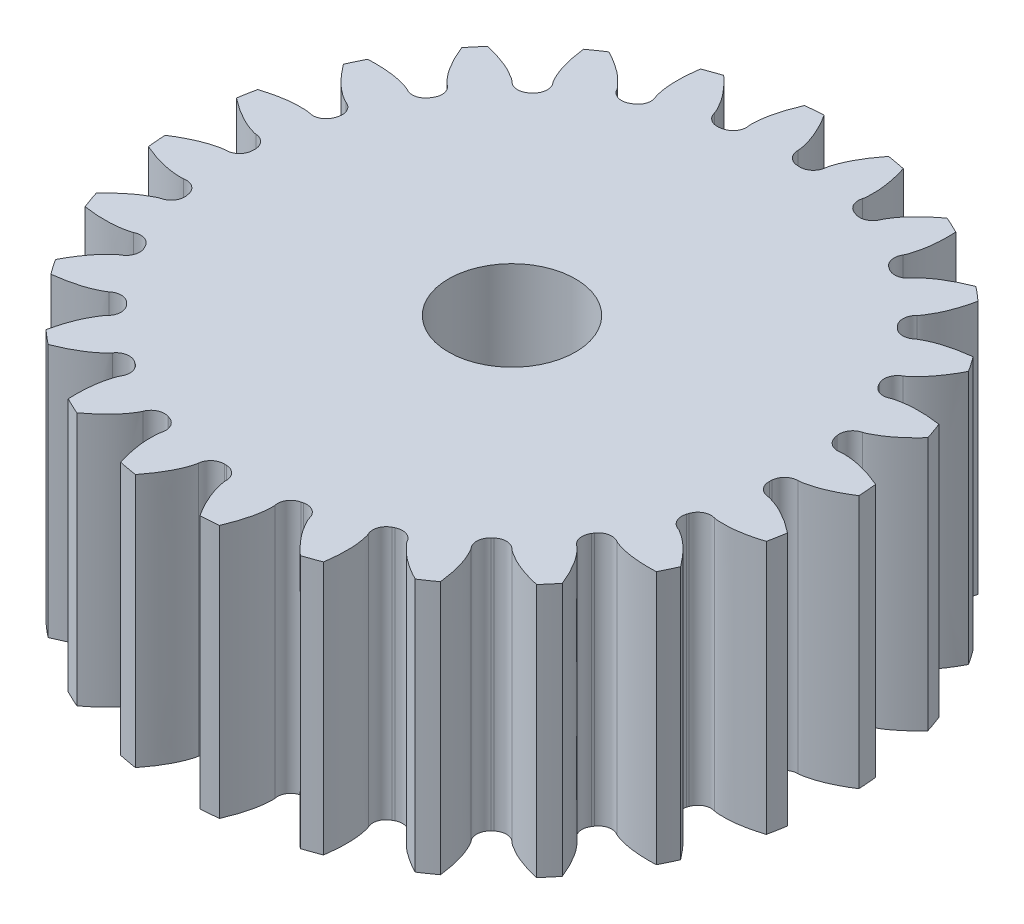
from build123d import *

# Parameters (mm, degrees)
ESQUISSE1_R             = 5.2
ESQUISSE1_R_2           = 1
BOSS_EXTRU_1_DEPTH      = 4
ESQUISSE2_OUTSIDE_W     = 15.448
ESQUISSE2_OUTSIDE_H     = 15.448
ENL_V_MAT_EXTRU_1_DEPTH = 9.371379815


with BuildPart() as part:
    # Esquisse1 → Boss.-Extru.1 (new body)
    with BuildSketch(Plane(origin=(0, 0, 0), x_dir=(1, 0, 0), z_dir=(0, 1, 0))):
        with Locations(Location((0, 0, 0), (0, 0, 270))):
            Circle(ESQUISSE1_R)
        with Locations(Location((0, 0, 0), (0, 0, 270))):
            Circle(ESQUISSE1_R_2, mode=Mode.SUBTRACT)
    extrude(amount=BOSS_EXTRU_1_DEPTH)

    # Esquisse2 outside → Enl_v. mat.-Extru.1 (cut, through all)
    with BuildSketch(Plane(origin=(0, 4, 0), x_dir=(1, 0, 0), z_dir=(0, 1, 0))):
        Rectangle(ESQUISSE2_OUTSIDE_W, ESQUISSE2_OUTSIDE_H)
        with BuildLine():
            ThreePointArc((5.192767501, 0.274163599), (5.183221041, 0.417396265), (5.169724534, 0.56031084))
            add(Edge.make_bspline(
                [(4.452870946, 0.721845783), (4.475733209, 0.725551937), (4.575678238, 0.72530917), (4.738040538, 0.704363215), (4.954249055, 0.646473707), (5.092861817, 0.593915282), (5.169724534, 0.56031084)],
                knots=[0, 0, 0, 0, 0.06948214, 0.297904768, 0.489604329, 0.740187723, 0.740187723, 0.740187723, 0.740187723], degree=3))
            ThreePointArc((4.452870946, 0.721845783), (4.296922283, 0.753905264), (4.207770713, 0.885813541))
            ThreePointArc((4.207770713, 0.885813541), (4.204404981, 0.901653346), (4.200979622, 0.917480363))
            ThreePointArc((4.200979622, 0.917480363), (4.228202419, 1.07434564), (4.357291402, 1.167532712))
            add(Edge.make_bspline(
                [(4.357291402, 1.167532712), (4.379662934, 1.173527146), (4.470719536, 1.214731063), (4.610215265, 1.300411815), (4.783673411, 1.441867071), (4.888545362, 1.546641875), (4.944869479, 1.608808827)],
                knots=[0, 0, 0, 0, 0.06948214, 0.297904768, 0.489604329, 0.740187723, 0.740187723, 0.740187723, 0.740187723], degree=3))
            ThreePointArc((4.944869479, 1.608808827), (4.898576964, 1.744690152), (4.848551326, 1.879241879))
            add(Edge.make_bspline(
                [(4.114315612, 1.849737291), (4.135439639, 1.85923435), (4.232041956, 1.884867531), (4.394293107, 1.906657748), (4.618117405, 1.90669966), (4.765610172, 1.891807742), (4.848551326, 1.879241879)],
                knots=[0, 0, 0, 0, 0.06948214, 0.297904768, 0.489604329, 0.740187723, 0.740187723, 0.740187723, 0.740187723], degree=3))
            ThreePointArc((4.114315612, 1.849737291), (3.955383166, 1.840341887), (3.835128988, 1.944681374))
            ThreePointArc((3.835128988, 1.944681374), (3.827778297, 1.959110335), (3.820373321, 1.973511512))
            ThreePointArc((3.820373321, 1.973511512), (3.806068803, 2.132077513), (3.906640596, 2.2555))
            add(Edge.make_bspline(
                [(3.906640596, 2.2555), (3.926698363, 2.267080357), (4.003987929, 2.330447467), (4.116554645, 2.44931287), (4.247491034, 2.630842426), (4.321671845, 2.759189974), (4.359986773, 2.833816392)],
                knots=[0, 0, 0, 0, 0.06948214, 0.297904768, 0.489604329, 0.740187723, 0.740187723, 0.740187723, 0.740187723], degree=3))
            ThreePointArc((4.359986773, 2.833816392), (4.280102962, 2.953086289), (4.196957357, 3.070105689))
            add(Edge.make_bspline(
                [(3.495376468, 2.851572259), (3.513322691, 2.866213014), (3.599999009, 2.915975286), (3.751081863, 2.979016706), (3.967268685, 3.036987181), (4.11359007, 3.060776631), (4.196957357, 3.070105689)],
                knots=[0, 0, 0, 0, 0.06948214, 0.297904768, 0.489604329, 0.740187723, 0.740187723, 0.740187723, 0.740187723], degree=3))
            ThreePointArc((3.495376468, 2.851572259), (3.344291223, 2.801362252), (3.20112956, 2.871022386))
            ThreePointArc((3.20112956, 2.871022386), (3.190294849, 2.883057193), (3.179414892, 2.895051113))
            ThreePointArc((3.179414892, 2.895051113), (3.124557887, 3.044511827), (3.18975869, 3.18975869))
            add(Edge.make_bspline(
                [(3.18975869, 3.18975869), (3.206135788, 3.206135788), (3.26439116, 3.287347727), (3.342357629, 3.4312973), (3.421849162, 3.640530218), (3.460283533, 3.783703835), (3.477978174, 3.865704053)],
                knots=[0, 0, 0, 0, 0.06948214, 0.297904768, 0.489604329, 0.740187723, 0.740187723, 0.740187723, 0.740187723], degree=3))
            ThreePointArc((3.477978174, 3.865704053), (3.369947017, 3.960234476), (3.259347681, 4.05174687))
            add(Edge.make_bspline(
                [(2.638233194, 3.65907729), (2.651778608, 3.677863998), (2.722622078, 3.748364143), (2.852240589, 3.8483606), (3.04605716, 3.960309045), (3.181235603, 4.02115865), (3.259347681, 4.05174687)],
                knots=[0, 0, 0, 0, 0.06948214, 0.297904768, 0.489604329, 0.740187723, 0.740187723, 0.740187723, 0.740187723], degree=3))
            ThreePointArc((2.638233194, 3.65907729), (2.50529136, 3.571474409), (2.348978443, 3.601707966))
            ThreePointArc((2.348978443, 3.601707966), (2.335398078, 3.610528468), (2.321784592, 3.619297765))
            ThreePointArc((2.321784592, 3.619297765), (2.230113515, 3.749467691), (2.2555, 3.906640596))
            add(Edge.make_bspline(
                [(2.2555, 3.906640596), (2.267080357, 3.926698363), (2.302331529, 4.020220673), (2.340384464, 4.179444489), (2.363013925, 4.402121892), (2.363082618, 4.550364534), (2.358951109, 4.634150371)],
                knots=[0, 0, 0, 0, 0.06948214, 0.297904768, 0.489604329, 0.740187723, 0.740187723, 0.740187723, 0.740187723], degree=3))
            ThreePointArc((2.358951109, 4.634150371), (2.230134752, 4.697499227), (2.099618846, 4.757268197))
            add(Edge.make_bspline(
                [(1.601298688, 4.217222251), (1.609520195, 4.238874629), (1.659702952, 4.325308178), (1.759023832, 4.455445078), (1.917261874, 4.613742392), (2.032085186, 4.707505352), (2.099618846, 4.757268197)],
                knots=[0, 0, 0, 0, 0.06948214, 0.297904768, 0.489604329, 0.740187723, 0.740187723, 0.740187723, 0.740187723], degree=3))
            ThreePointArc((1.601298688, 4.217222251), (1.495560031, 4.098196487), (1.336748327, 4.086943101))
            ThreePointArc((1.336748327, 4.086943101), (1.321347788, 4.091948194), (1.305928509, 4.096895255))
            ThreePointArc((1.305928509, 4.096895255), (1.183690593, 4.198903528), (1.167532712, 4.357291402))
            add(Edge.make_bspline(
                [(1.167532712, 4.357291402), (1.173527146, 4.379662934), (1.183371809, 4.479122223), (1.178917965, 4.642769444), (1.143143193, 4.863716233), (1.104841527, 5.006925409), (1.079165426, 5.086787)],
                knots=[0, 0, 0, 0, 0.06948214, 0.297904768, 0.489604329, 0.740187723, 0.740187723, 0.740187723, 0.740187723], degree=3))
            ThreePointArc((1.079165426, 5.086787), (0.938342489, 5.114637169), (0.796804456, 5.138589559))
            add(Edge.make_bspline(
                [(0.455238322, 4.487970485), (0.457575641, 4.511012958), (0.483677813, 4.607489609), (0.545932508, 4.758898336), (0.65780836, 4.95275682), (0.744451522, 5.073043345), (0.796804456, 5.138589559)],
                knots=[0, 0, 0, 0, 0.06948214, 0.297904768, 0.489604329, 0.740187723, 0.740187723, 0.740187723, 0.740187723], degree=3))
            ThreePointArc((0.455238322, 4.487970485), (0.383908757, 4.345633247), (0.233421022, 4.293659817))
            ThreePointArc((0.233421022, 4.293659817), (0.21724983, 4.294508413), (0.201075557, 4.295296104))
            ThreePointArc((0.201075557, 4.295296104), (0.056601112, 4.362191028), (0, 4.511))
            add(Edge.make_bspline(
                [(0, 4.511), (0, 4.534160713), (-0.016232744, 4.632778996), (-0.062889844, 4.789697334), (-0.154630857, 4.993856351), (-0.228692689, 5.122272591), (-0.274163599, 5.192767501)],
                knots=[0, 0, 0, 0, 0.06948214, 0.297904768, 0.489604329, 0.740187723, 0.740187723, 0.740187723, 0.740187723], degree=3))
            ThreePointArc((-0.274163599, 5.192767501), (-0.417396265, 5.183221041), (-0.56031084, 5.169724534))
            add(Edge.make_bspline(
                [(-0.721845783, 4.452870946), (-0.725551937, 4.475733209), (-0.72530917, 4.575678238), (-0.704363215, 4.738040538), (-0.646473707, 4.954249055), (-0.593915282, 5.092861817), (-0.56031084, 5.169724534)],
                knots=[0, 0, 0, 0, 0.06948214, 0.297904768, 0.489604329, 0.740187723, 0.740187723, 0.740187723, 0.740187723], degree=3))
            ThreePointArc((-0.721845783, 4.452870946), (-0.753905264, 4.296922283), (-0.885813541, 4.207770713))
            ThreePointArc((-0.885813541, 4.207770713), (-0.901653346, 4.204404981), (-0.917480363, 4.200979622))
            ThreePointArc((-0.917480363, 4.200979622), (-1.07434564, 4.228202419), (-1.167532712, 4.357291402))
            add(Edge.make_bspline(
                [(-1.167532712, 4.357291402), (-1.173527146, 4.379662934), (-1.214731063, 4.470719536), (-1.300411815, 4.610215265), (-1.441867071, 4.783673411), (-1.546641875, 4.888545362), (-1.608808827, 4.944869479)],
                knots=[0, 0, 0, 0, 0.06948214, 0.297904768, 0.489604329, 0.740187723, 0.740187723, 0.740187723, 0.740187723], degree=3))
            ThreePointArc((-1.608808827, 4.944869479), (-1.744690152, 4.898576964), (-1.879241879, 4.848551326))
            add(Edge.make_bspline(
                [(-1.849737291, 4.114315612), (-1.85923435, 4.135439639), (-1.884867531, 4.232041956), (-1.906657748, 4.394293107), (-1.90669966, 4.618117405), (-1.891807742, 4.765610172), (-1.879241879, 4.848551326)],
                knots=[0, 0, 0, 0, 0.06948214, 0.297904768, 0.489604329, 0.740187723, 0.740187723, 0.740187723, 0.740187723], degree=3))
            ThreePointArc((-1.849737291, 4.114315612), (-1.840341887, 3.955383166), (-1.944681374, 3.835128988))
            ThreePointArc((-1.944681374, 3.835128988), (-1.959110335, 3.827778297), (-1.973511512, 3.820373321))
            ThreePointArc((-1.973511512, 3.820373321), (-2.132077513, 3.806068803), (-2.2555, 3.906640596))
            add(Edge.make_bspline(
                [(-2.2555, 3.906640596), (-2.267080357, 3.926698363), (-2.330447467, 4.003987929), (-2.44931287, 4.116554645), (-2.630842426, 4.247491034), (-2.759189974, 4.321671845), (-2.833816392, 4.359986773)],
                knots=[0, 0, 0, 0, 0.06948214, 0.297904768, 0.489604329, 0.740187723, 0.740187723, 0.740187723, 0.740187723], degree=3))
            ThreePointArc((-2.833816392, 4.359986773), (-2.953086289, 4.280102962), (-3.070105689, 4.196957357))
            add(Edge.make_bspline(
                [(-2.851572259, 3.495376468), (-2.866213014, 3.513322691), (-2.915975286, 3.599999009), (-2.979016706, 3.751081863), (-3.036987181, 3.967268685), (-3.060776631, 4.11359007), (-3.070105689, 4.196957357)],
                knots=[0, 0, 0, 0, 0.06948214, 0.297904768, 0.489604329, 0.740187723, 0.740187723, 0.740187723, 0.740187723], degree=3))
            ThreePointArc((-2.851572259, 3.495376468), (-2.801362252, 3.344291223), (-2.871022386, 3.20112956))
            ThreePointArc((-2.871022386, 3.20112956), (-2.883057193, 3.190294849), (-2.895051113, 3.179414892))
            ThreePointArc((-2.895051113, 3.179414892), (-3.044511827, 3.124557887), (-3.18975869, 3.18975869))
            add(Edge.make_bspline(
                [(-3.18975869, 3.18975869), (-3.206135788, 3.206135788), (-3.287347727, 3.26439116), (-3.4312973, 3.342357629), (-3.640530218, 3.421849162), (-3.783703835, 3.460283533), (-3.865704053, 3.477978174)],
                knots=[0, 0, 0, 0, 0.06948214, 0.297904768, 0.489604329, 0.740187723, 0.740187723, 0.740187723, 0.740187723], degree=3))
            ThreePointArc((-3.865704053, 3.477978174), (-3.960234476, 3.369947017), (-4.05174687, 3.259347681))
            add(Edge.make_bspline(
                [(-3.65907729, 2.638233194), (-3.677863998, 2.651778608), (-3.748364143, 2.722622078), (-3.8483606, 2.852240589), (-3.960309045, 3.04605716), (-4.02115865, 3.181235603), (-4.05174687, 3.259347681)],
                knots=[0, 0, 0, 0, 0.06948214, 0.297904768, 0.489604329, 0.740187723, 0.740187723, 0.740187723, 0.740187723], degree=3))
            ThreePointArc((-3.65907729, 2.638233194), (-3.571474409, 2.50529136), (-3.601707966, 2.348978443))
            ThreePointArc((-3.601707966, 2.348978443), (-3.610528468, 2.335398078), (-3.619297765, 2.321784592))
            ThreePointArc((-3.619297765, 2.321784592), (-3.749467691, 2.230113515), (-3.906640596, 2.2555))
            add(Edge.make_bspline(
                [(-3.906640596, 2.2555), (-3.926698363, 2.267080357), (-4.020220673, 2.302331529), (-4.179444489, 2.340384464), (-4.402121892, 2.363013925), (-4.550364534, 2.363082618), (-4.634150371, 2.358951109)],
                knots=[0, 0, 0, 0, 0.06948214, 0.297904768, 0.489604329, 0.740187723, 0.740187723, 0.740187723, 0.740187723], degree=3))
            ThreePointArc((-4.634150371, 2.358951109), (-4.697499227, 2.230134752), (-4.757268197, 2.099618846))
            add(Edge.make_bspline(
                [(-4.217222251, 1.601298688), (-4.238874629, 1.609520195), (-4.325308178, 1.659702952), (-4.455445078, 1.759023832), (-4.613742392, 1.917261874), (-4.707505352, 2.032085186), (-4.757268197, 2.099618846)],
                knots=[0, 0, 0, 0, 0.06948214, 0.297904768, 0.489604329, 0.740187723, 0.740187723, 0.740187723, 0.740187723], degree=3))
            ThreePointArc((-4.217222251, 1.601298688), (-4.098196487, 1.495560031), (-4.086943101, 1.336748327))
            ThreePointArc((-4.086943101, 1.336748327), (-4.091948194, 1.321347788), (-4.096895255, 1.305928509))
            ThreePointArc((-4.096895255, 1.305928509), (-4.198903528, 1.183690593), (-4.357291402, 1.167532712))
            add(Edge.make_bspline(
                [(-4.357291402, 1.167532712), (-4.379662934, 1.173527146), (-4.479122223, 1.183371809), (-4.642769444, 1.178917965), (-4.863716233, 1.143143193), (-5.006925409, 1.104841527), (-5.086787, 1.079165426)],
                knots=[0, 0, 0, 0, 0.06948214, 0.297904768, 0.489604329, 0.740187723, 0.740187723, 0.740187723, 0.740187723], degree=3))
            ThreePointArc((-5.086787, 1.079165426), (-5.114637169, 0.938342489), (-5.138589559, 0.796804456))
            add(Edge.make_bspline(
                [(-4.487970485, 0.455238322), (-4.511012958, 0.457575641), (-4.607489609, 0.483677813), (-4.758898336, 0.545932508), (-4.95275682, 0.65780836), (-5.073043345, 0.744451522), (-5.138589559, 0.796804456)],
                knots=[0, 0, 0, 0, 0.06948214, 0.297904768, 0.489604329, 0.740187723, 0.740187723, 0.740187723, 0.740187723], degree=3))
            ThreePointArc((-4.487970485, 0.455238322), (-4.345633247, 0.383908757), (-4.293659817, 0.233421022))
            ThreePointArc((-4.293659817, 0.233421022), (-4.294508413, 0.21724983), (-4.295296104, 0.201075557))
            ThreePointArc((-4.295296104, 0.201075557), (-4.362191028, 0.056601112), (-4.511, 0))
            add(Edge.make_bspline(
                [(-4.511, 0), (-4.534160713, 0), (-4.632778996, -0.016232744), (-4.789697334, -0.062889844), (-4.993856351, -0.154630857), (-5.122272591, -0.228692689), (-5.192767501, -0.274163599)],
                knots=[0, 0, 0, 0, 0.06948214, 0.297904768, 0.489604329, 0.740187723, 0.740187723, 0.740187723, 0.740187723], degree=3))
            ThreePointArc((-5.192767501, -0.274163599), (-5.183221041, -0.417396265), (-5.169724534, -0.56031084))
            add(Edge.make_bspline(
                [(-4.452870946, -0.721845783), (-4.475733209, -0.725551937), (-4.575678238, -0.72530917), (-4.738040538, -0.704363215), (-4.954249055, -0.646473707), (-5.092861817, -0.593915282), (-5.169724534, -0.56031084)],
                knots=[0, 0, 0, 0, 0.06948214, 0.297904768, 0.489604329, 0.740187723, 0.740187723, 0.740187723, 0.740187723], degree=3))
            ThreePointArc((-4.452870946, -0.721845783), (-4.296922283, -0.753905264), (-4.207770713, -0.885813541))
            ThreePointArc((-4.207770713, -0.885813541), (-4.204404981, -0.901653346), (-4.200979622, -0.917480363))
            ThreePointArc((-4.200979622, -0.917480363), (-4.228202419, -1.07434564), (-4.357291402, -1.167532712))
            add(Edge.make_bspline(
                [(-4.357291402, -1.167532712), (-4.379662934, -1.173527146), (-4.470719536, -1.214731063), (-4.610215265, -1.300411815), (-4.783673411, -1.441867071), (-4.888545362, -1.546641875), (-4.944869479, -1.608808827)],
                knots=[0, 0, 0, 0, 0.06948214, 0.297904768, 0.489604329, 0.740187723, 0.740187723, 0.740187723, 0.740187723], degree=3))
            ThreePointArc((-4.944869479, -1.608808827), (-4.898576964, -1.744690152), (-4.848551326, -1.879241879))
            add(Edge.make_bspline(
                [(-4.114315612, -1.849737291), (-4.135439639, -1.85923435), (-4.232041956, -1.884867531), (-4.394293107, -1.906657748), (-4.618117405, -1.90669966), (-4.765610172, -1.891807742), (-4.848551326, -1.879241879)],
                knots=[0, 0, 0, 0, 0.06948214, 0.297904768, 0.489604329, 0.740187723, 0.740187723, 0.740187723, 0.740187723], degree=3))
            ThreePointArc((-4.114315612, -1.849737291), (-3.955383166, -1.840341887), (-3.835128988, -1.944681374))
            ThreePointArc((-3.835128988, -1.944681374), (-3.827778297, -1.959110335), (-3.820373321, -1.973511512))
            ThreePointArc((-3.820373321, -1.973511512), (-3.806068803, -2.132077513), (-3.906640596, -2.2555))
            add(Edge.make_bspline(
                [(-3.906640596, -2.2555), (-3.926698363, -2.267080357), (-4.003987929, -2.330447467), (-4.116554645, -2.44931287), (-4.247491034, -2.630842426), (-4.321671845, -2.759189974), (-4.359986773, -2.833816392)],
                knots=[0, 0, 0, 0, 0.06948214, 0.297904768, 0.489604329, 0.740187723, 0.740187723, 0.740187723, 0.740187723], degree=3))
            ThreePointArc((-4.359986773, -2.833816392), (-4.280102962, -2.953086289), (-4.196957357, -3.070105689))
            add(Edge.make_bspline(
                [(-3.495376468, -2.851572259), (-3.513322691, -2.866213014), (-3.599999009, -2.915975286), (-3.751081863, -2.979016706), (-3.967268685, -3.036987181), (-4.11359007, -3.060776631), (-4.196957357, -3.070105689)],
                knots=[0, 0, 0, 0, 0.06948214, 0.297904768, 0.489604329, 0.740187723, 0.740187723, 0.740187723, 0.740187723], degree=3))
            ThreePointArc((-3.495376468, -2.851572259), (-3.344291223, -2.801362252), (-3.20112956, -2.871022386))
            ThreePointArc((-3.20112956, -2.871022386), (-3.190294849, -2.883057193), (-3.179414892, -2.895051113))
            ThreePointArc((-3.179414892, -2.895051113), (-3.124557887, -3.044511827), (-3.18975869, -3.18975869))
            add(Edge.make_bspline(
                [(-3.18975869, -3.18975869), (-3.206135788, -3.206135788), (-3.26439116, -3.287347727), (-3.342357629, -3.4312973), (-3.421849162, -3.640530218), (-3.460283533, -3.783703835), (-3.477978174, -3.865704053)],
                knots=[0, 0, 0, 0, 0.06948214, 0.297904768, 0.489604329, 0.740187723, 0.740187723, 0.740187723, 0.740187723], degree=3))
            ThreePointArc((-3.477978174, -3.865704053), (-3.369947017, -3.960234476), (-3.259347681, -4.05174687))
            add(Edge.make_bspline(
                [(-2.638233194, -3.65907729), (-2.651778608, -3.677863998), (-2.722622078, -3.748364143), (-2.852240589, -3.8483606), (-3.04605716, -3.960309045), (-3.181235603, -4.02115865), (-3.259347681, -4.05174687)],
                knots=[0, 0, 0, 0, 0.06948214, 0.297904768, 0.489604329, 0.740187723, 0.740187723, 0.740187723, 0.740187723], degree=3))
            ThreePointArc((-2.638233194, -3.65907729), (-2.50529136, -3.571474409), (-2.348978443, -3.601707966))
            ThreePointArc((-2.348978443, -3.601707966), (-2.335398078, -3.610528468), (-2.321784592, -3.619297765))
            ThreePointArc((-2.321784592, -3.619297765), (-2.230113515, -3.749467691), (-2.2555, -3.906640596))
            add(Edge.make_bspline(
                [(-2.2555, -3.906640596), (-2.267080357, -3.926698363), (-2.302331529, -4.020220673), (-2.340384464, -4.179444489), (-2.363013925, -4.402121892), (-2.363082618, -4.550364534), (-2.358951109, -4.634150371)],
                knots=[0, 0, 0, 0, 0.06948214, 0.297904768, 0.489604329, 0.740187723, 0.740187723, 0.740187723, 0.740187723], degree=3))
            ThreePointArc((-2.358951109, -4.634150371), (-2.230134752, -4.697499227), (-2.099618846, -4.757268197))
            add(Edge.make_bspline(
                [(-1.601298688, -4.217222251), (-1.609520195, -4.238874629), (-1.659702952, -4.325308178), (-1.759023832, -4.455445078), (-1.917261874, -4.613742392), (-2.032085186, -4.707505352), (-2.099618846, -4.757268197)],
                knots=[0, 0, 0, 0, 0.06948214, 0.297904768, 0.489604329, 0.740187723, 0.740187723, 0.740187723, 0.740187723], degree=3))
            ThreePointArc((-1.601298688, -4.217222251), (-1.495560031, -4.098196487), (-1.336748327, -4.086943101))
            ThreePointArc((-1.336748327, -4.086943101), (-1.321347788, -4.091948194), (-1.305928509, -4.096895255))
            ThreePointArc((-1.305928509, -4.096895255), (-1.183690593, -4.198903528), (-1.167532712, -4.357291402))
            add(Edge.make_bspline(
                [(-1.167532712, -4.357291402), (-1.173527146, -4.379662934), (-1.183371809, -4.479122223), (-1.178917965, -4.642769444), (-1.143143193, -4.863716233), (-1.104841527, -5.006925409), (-1.079165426, -5.086787)],
                knots=[0, 0, 0, 0, 0.06948214, 0.297904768, 0.489604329, 0.740187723, 0.740187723, 0.740187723, 0.740187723], degree=3))
            ThreePointArc((-1.079165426, -5.086787), (-0.938342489, -5.114637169), (-0.796804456, -5.138589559))
            add(Edge.make_bspline(
                [(-0.455238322, -4.487970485), (-0.457575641, -4.511012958), (-0.483677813, -4.607489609), (-0.545932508, -4.758898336), (-0.65780836, -4.95275682), (-0.744451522, -5.073043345), (-0.796804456, -5.138589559)],
                knots=[0, 0, 0, 0, 0.06948214, 0.297904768, 0.489604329, 0.740187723, 0.740187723, 0.740187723, 0.740187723], degree=3))
            ThreePointArc((-0.455238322, -4.487970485), (-0.383908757, -4.345633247), (-0.233421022, -4.293659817))
            ThreePointArc((-0.233421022, -4.293659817), (-0.21724983, -4.294508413), (-0.201075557, -4.295296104))
            ThreePointArc((-0.201075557, -4.295296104), (-0.056601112, -4.362191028), (0, -4.511))
            add(Edge.make_bspline(
                [(0, -4.511), (0, -4.534160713), (0.016232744, -4.632778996), (0.062889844, -4.789697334), (0.154630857, -4.993856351), (0.228692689, -5.122272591), (0.274163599, -5.192767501)],
                knots=[0, 0, 0, 0, 0.06948214, 0.297904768, 0.489604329, 0.740187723, 0.740187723, 0.740187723, 0.740187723], degree=3))
            ThreePointArc((0.274163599, -5.192767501), (0.417396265, -5.183221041), (0.56031084, -5.169724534))
            add(Edge.make_bspline(
                [(0.721845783, -4.452870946), (0.725551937, -4.475733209), (0.72530917, -4.575678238), (0.704363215, -4.738040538), (0.646473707, -4.954249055), (0.593915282, -5.092861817), (0.56031084, -5.169724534)],
                knots=[0, 0, 0, 0, 0.06948214, 0.297904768, 0.489604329, 0.740187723, 0.740187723, 0.740187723, 0.740187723], degree=3))
            ThreePointArc((0.721845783, -4.452870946), (0.753905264, -4.296922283), (0.885813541, -4.207770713))
            ThreePointArc((0.885813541, -4.207770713), (0.901653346, -4.204404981), (0.917480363, -4.200979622))
            ThreePointArc((0.917480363, -4.200979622), (1.07434564, -4.228202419), (1.167532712, -4.357291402))
            add(Edge.make_bspline(
                [(1.167532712, -4.357291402), (1.173527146, -4.379662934), (1.214731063, -4.470719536), (1.300411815, -4.610215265), (1.441867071, -4.783673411), (1.546641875, -4.888545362), (1.608808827, -4.944869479)],
                knots=[0, 0, 0, 0, 0.06948214, 0.297904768, 0.489604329, 0.740187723, 0.740187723, 0.740187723, 0.740187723], degree=3))
            ThreePointArc((1.608808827, -4.944869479), (1.744690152, -4.898576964), (1.879241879, -4.848551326))
            add(Edge.make_bspline(
                [(1.849737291, -4.114315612), (1.85923435, -4.135439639), (1.884867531, -4.232041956), (1.906657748, -4.394293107), (1.90669966, -4.618117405), (1.891807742, -4.765610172), (1.879241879, -4.848551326)],
                knots=[0, 0, 0, 0, 0.06948214, 0.297904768, 0.489604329, 0.740187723, 0.740187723, 0.740187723, 0.740187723], degree=3))
            ThreePointArc((1.849737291, -4.114315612), (1.840341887, -3.955383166), (1.944681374, -3.835128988))
            ThreePointArc((1.944681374, -3.835128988), (1.959110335, -3.827778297), (1.973511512, -3.820373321))
            ThreePointArc((1.973511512, -3.820373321), (2.132077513, -3.806068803), (2.2555, -3.906640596))
            add(Edge.make_bspline(
                [(2.2555, -3.906640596), (2.267080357, -3.926698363), (2.330447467, -4.003987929), (2.44931287, -4.116554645), (2.630842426, -4.247491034), (2.759189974, -4.321671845), (2.833816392, -4.359986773)],
                knots=[0, 0, 0, 0, 0.06948214, 0.297904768, 0.489604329, 0.740187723, 0.740187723, 0.740187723, 0.740187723], degree=3))
            ThreePointArc((2.833816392, -4.359986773), (2.953086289, -4.280102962), (3.070105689, -4.196957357))
            add(Edge.make_bspline(
                [(2.851572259, -3.495376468), (2.866213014, -3.513322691), (2.915975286, -3.599999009), (2.979016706, -3.751081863), (3.036987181, -3.967268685), (3.060776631, -4.11359007), (3.070105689, -4.196957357)],
                knots=[0, 0, 0, 0, 0.06948214, 0.297904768, 0.489604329, 0.740187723, 0.740187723, 0.740187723, 0.740187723], degree=3))
            ThreePointArc((2.851572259, -3.495376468), (2.801362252, -3.344291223), (2.871022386, -3.20112956))
            ThreePointArc((2.871022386, -3.20112956), (2.883057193, -3.190294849), (2.895051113, -3.179414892))
            ThreePointArc((2.895051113, -3.179414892), (3.044511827, -3.124557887), (3.18975869, -3.18975869))
            add(Edge.make_bspline(
                [(3.18975869, -3.18975869), (3.206135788, -3.206135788), (3.287347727, -3.26439116), (3.4312973, -3.342357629), (3.640530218, -3.421849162), (3.783703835, -3.460283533), (3.865704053, -3.477978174)],
                knots=[0, 0, 0, 0, 0.06948214, 0.297904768, 0.489604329, 0.740187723, 0.740187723, 0.740187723, 0.740187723], degree=3))
            ThreePointArc((3.865704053, -3.477978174), (3.960234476, -3.369947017), (4.05174687, -3.259347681))
            add(Edge.make_bspline(
                [(3.65907729, -2.638233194), (3.677863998, -2.651778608), (3.748364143, -2.722622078), (3.8483606, -2.852240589), (3.960309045, -3.04605716), (4.02115865, -3.181235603), (4.05174687, -3.259347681)],
                knots=[0, 0, 0, 0, 0.06948214, 0.297904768, 0.489604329, 0.740187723, 0.740187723, 0.740187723, 0.740187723], degree=3))
            ThreePointArc((3.65907729, -2.638233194), (3.571474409, -2.50529136), (3.601707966, -2.348978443))
            ThreePointArc((3.601707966, -2.348978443), (3.610528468, -2.335398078), (3.619297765, -2.321784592))
            ThreePointArc((3.619297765, -2.321784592), (3.749467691, -2.230113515), (3.906640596, -2.2555))
            add(Edge.make_bspline(
                [(3.906640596, -2.2555), (3.926698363, -2.267080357), (4.020220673, -2.302331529), (4.179444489, -2.340384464), (4.402121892, -2.363013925), (4.550364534, -2.363082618), (4.634150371, -2.358951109)],
                knots=[0, 0, 0, 0, 0.06948214, 0.297904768, 0.489604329, 0.740187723, 0.740187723, 0.740187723, 0.740187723], degree=3))
            ThreePointArc((4.634150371, -2.358951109), (4.697499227, -2.230134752), (4.757268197, -2.099618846))
            add(Edge.make_bspline(
                [(4.217222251, -1.601298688), (4.238874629, -1.609520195), (4.325308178, -1.659702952), (4.455445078, -1.759023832), (4.613742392, -1.917261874), (4.707505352, -2.032085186), (4.757268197, -2.099618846)],
                knots=[0, 0, 0, 0, 0.06948214, 0.297904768, 0.489604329, 0.740187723, 0.740187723, 0.740187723, 0.740187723], degree=3))
            ThreePointArc((4.217222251, -1.601298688), (4.098196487, -1.495560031), (4.086943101, -1.336748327))
            ThreePointArc((4.086943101, -1.336748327), (4.091948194, -1.321347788), (4.096895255, -1.305928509))
            ThreePointArc((4.096895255, -1.305928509), (4.198903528, -1.183690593), (4.357291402, -1.167532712))
            add(Edge.make_bspline(
                [(4.357291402, -1.167532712), (4.379662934, -1.173527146), (4.479122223, -1.183371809), (4.642769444, -1.178917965), (4.863716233, -1.143143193), (5.006925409, -1.104841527), (5.086787, -1.079165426)],
                knots=[0, 0, 0, 0, 0.06948214, 0.297904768, 0.489604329, 0.740187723, 0.740187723, 0.740187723, 0.740187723], degree=3))
            ThreePointArc((5.086787, -1.079165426), (5.114637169, -0.938342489), (5.138589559, -0.796804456))
            add(Edge.make_bspline(
                [(4.487970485, -0.455238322), (4.511012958, -0.457575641), (4.607489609, -0.483677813), (4.758898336, -0.545932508), (4.95275682, -0.65780836), (5.073043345, -0.744451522), (5.138589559, -0.796804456)],
                knots=[0, 0, 0, 0, 0.06948214, 0.297904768, 0.489604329, 0.740187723, 0.740187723, 0.740187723, 0.740187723], degree=3))
            ThreePointArc((4.487970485, -0.455238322), (4.345633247, -0.383908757), (4.293659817, -0.233421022))
            ThreePointArc((4.293659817, -0.233421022), (4.294508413, -0.21724983), (4.295296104, -0.201075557))
            ThreePointArc((4.295296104, -0.201075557), (4.362191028, -0.056601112), (4.511, 0))
            add(Edge.make_bspline(
                [(4.511, 0), (4.534160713, 0), (4.632778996, 0.016232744), (4.789697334, 0.062889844), (4.993856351, 0.154630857), (5.122272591, 0.228692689), (5.192767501, 0.274163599)],
                knots=[0, 0, 0, 0, 0.06948214, 0.297904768, 0.489604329, 0.740187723, 0.740187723, 0.740187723, 0.740187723], degree=3))
        make_face(mode=Mode.SUBTRACT)
    extrude(amount=-ENL_V_MAT_EXTRU_1_DEPTH, mode=Mode.SUBTRACT)


solid = part.part
